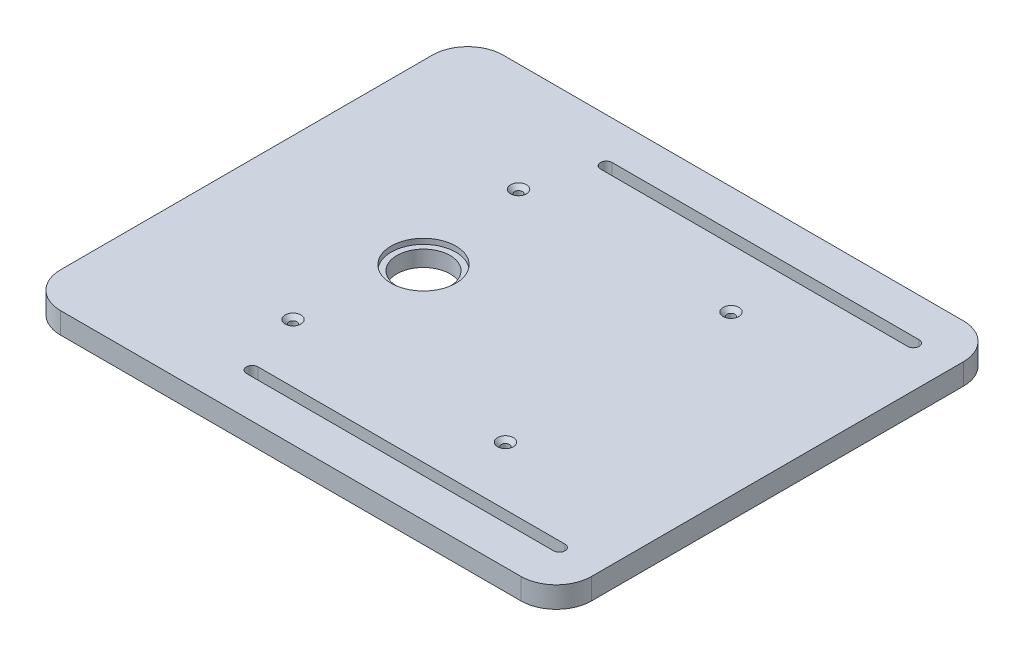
ISO-10303-21;
HEADER;
FILE_DESCRIPTION(('STEP AP214'),'2;1');
FILE_NAME('part.step','',(''),(''),'','','');
FILE_SCHEMA(('AUTOMOTIVE_DESIGN { 1 0 10303 214 1 1 1 1 }'));
ENDSEC;
DATA;
#1=APPLICATION_CONTEXT('core data for automotive mechanical design processes');
#2=APPLICATION_PROTOCOL_DEFINITION('international standard','automotive_design',2000,#1);
#3=PRODUCT_CONTEXT('',#1,'mechanical');
#4=PRODUCT('Part','Part','',(#3));
#5=PRODUCT_RELATED_PRODUCT_CATEGORY('part','',(#4));
#6=PRODUCT_DEFINITION_FORMATION('','',#4);
#7=PRODUCT_DEFINITION_CONTEXT('part definition',#1,'design');
#8=PRODUCT_DEFINITION('design','',#6,#7);
#9=PRODUCT_DEFINITION_SHAPE('','',#8);
#10=(LENGTH_UNIT() NAMED_UNIT(*) SI_UNIT(.MILLI.,.METRE.));
#11=(NAMED_UNIT(*) PLANE_ANGLE_UNIT() SI_UNIT($,.RADIAN.));
#12=(NAMED_UNIT(*) SI_UNIT($,.STERADIAN.) SOLID_ANGLE_UNIT());
#13=UNCERTAINTY_MEASURE_WITH_UNIT(LENGTH_MEASURE(1.E-05),#10,'distance_accuracy_value','');
#14=(GEOMETRIC_REPRESENTATION_CONTEXT(3) GLOBAL_UNCERTAINTY_ASSIGNED_CONTEXT((#13)) GLOBAL_UNIT_ASSIGNED_CONTEXT((#10,
#11,#12)) REPRESENTATION_CONTEXT('',''));
#15=CARTESIAN_POINT('',(0.,0.,0.));
#16=DIRECTION('',(0.,0.,1.));
#17=DIRECTION('',(1.,0.,0.));
#18=AXIS2_PLACEMENT_3D('',#15,#16,#17);
#19=CARTESIAN_POINT('',(20.,12.,-20.));
#20=DIRECTION('',(0.,-1.,0.));
#21=DIRECTION('',(0.,0.,-1.));
#22=AXIS2_PLACEMENT_3D('',#19,#20,#21);
#23=PLANE('',#22);
#24=CARTESIAN_POINT('',(90.,12.,-188.7));
#25=DIRECTION('',(0.,1.,0.));
#26=DIRECTION('',(0.,0.,1.));
#27=AXIS2_PLACEMENT_3D('',#24,#25,#26);
#28=CIRCLE('',#27,4.48);
#29=CARTESIAN_POINT('',(90.,12.,-184.22));
#30=VERTEX_POINT('',#29);
#31=EDGE_CURVE('E825',#30,#30,#28,.T.);
#32=ORIENTED_EDGE('',*,*,#31,.F.);
#33=EDGE_LOOP('',(#32));
#34=FACE_BOUND('',#33,.T.);
#35=CARTESIAN_POINT('',(210.,12.,-188.7));
#36=DIRECTION('',(0.,1.,0.));
#37=DIRECTION('',(0.,0.,1.));
#38=AXIS2_PLACEMENT_3D('',#35,#36,#37);
#39=CIRCLE('',#38,4.48000000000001);
#40=CARTESIAN_POINT('',(210.,12.,-184.22));
#41=VERTEX_POINT('',#40);
#42=EDGE_CURVE('E694',#41,#41,#39,.T.);
#43=ORIENTED_EDGE('',*,*,#42,.F.);
#44=EDGE_LOOP('',(#43));
#45=FACE_BOUND('',#44,.T.);
#46=CARTESIAN_POINT('',(90.,12.,-61.3));
#47=DIRECTION('',(0.,1.,0.));
#48=DIRECTION('',(0.,0.,1.));
#49=AXIS2_PLACEMENT_3D('',#46,#47,#48);
#50=CIRCLE('',#49,4.48);
#51=CARTESIAN_POINT('',(90.,12.,-56.82));
#52=VERTEX_POINT('',#51);
#53=EDGE_CURVE('E683',#52,#52,#50,.T.);
#54=ORIENTED_EDGE('',*,*,#53,.F.);
#55=EDGE_LOOP('',(#54));
#56=FACE_BOUND('',#55,.T.);
#57=DIRECTION('',(1.,0.,0.));
#58=VECTOR('',#57,1.);
#59=CARTESIAN_POINT('',(103.25,12.,-21.7499999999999));
#60=LINE('',#59,#58);
#61=CARTESIAN_POINT('',(103.25,12.,-21.75));
#62=VERTEX_POINT('',#61);
#63=CARTESIAN_POINT('',(276.75,12.,-21.75));
#64=VERTEX_POINT('',#63);
#65=EDGE_CURVE('E526',#62,#64,#60,.T.);
#66=ORIENTED_EDGE('',*,*,#65,.F.);
#67=CARTESIAN_POINT('',(103.25,12.,-25.));
#68=DIRECTION('',(0.,1.,0.));
#69=DIRECTION('',(0.,0.,1.));
#70=AXIS2_PLACEMENT_3D('',#67,#68,#69);
#71=CIRCLE('',#70,3.25);
#72=CARTESIAN_POINT('',(103.25,12.,-28.25));
#73=VERTEX_POINT('',#72);
#74=EDGE_CURVE('E550',#73,#62,#71,.T.);
#75=ORIENTED_EDGE('',*,*,#74,.F.);
#76=DIRECTION('',(1.,0.,0.));
#77=VECTOR('',#76,1.);
#78=CARTESIAN_POINT('',(103.25,12.,-28.25));
#79=LINE('',#78,#77);
#80=CARTESIAN_POINT('',(276.75,12.,-28.25));
#81=VERTEX_POINT('',#80);
#82=EDGE_CURVE('E547',#73,#81,#79,.T.);
#83=ORIENTED_EDGE('',*,*,#82,.T.);
#84=CARTESIAN_POINT('',(276.75,12.,-25.));
#85=DIRECTION('',(0.,1.,0.));
#86=DIRECTION('',(0.,0.,1.));
#87=AXIS2_PLACEMENT_3D('',#84,#85,#86);
#88=CIRCLE('',#87,3.25);
#89=EDGE_CURVE('E560',#64,#81,#88,.T.);
#90=ORIENTED_EDGE('',*,*,#89,.F.);
#91=EDGE_LOOP('',(#66,#75,#83,#90));
#92=FACE_BOUND('',#91,.T.);
#93=CARTESIAN_POINT('',(276.75,12.,-225.));
#94=DIRECTION('',(0.,1.,0.));
#95=DIRECTION('',(0.,0.,1.));
#96=AXIS2_PLACEMENT_3D('',#93,#94,#95);
#97=CIRCLE('',#96,3.25);
#98=CARTESIAN_POINT('',(276.75,12.,-221.75));
#99=VERTEX_POINT('',#98);
#100=CARTESIAN_POINT('',(276.75,12.,-228.25));
#101=VERTEX_POINT('',#100);
#102=EDGE_CURVE('E591',#99,#101,#97,.T.);
#103=ORIENTED_EDGE('',*,*,#102,.F.);
#104=DIRECTION('',(1.,0.,0.));
#105=VECTOR('',#104,1.);
#106=CARTESIAN_POINT('',(103.25,12.,-221.75));
#107=LINE('',#106,#105);
#108=CARTESIAN_POINT('',(103.25,12.,-221.75));
#109=VERTEX_POINT('',#108);
#110=EDGE_CURVE('E570',#109,#99,#107,.T.);
#111=ORIENTED_EDGE('',*,*,#110,.F.);
#112=CARTESIAN_POINT('',(103.25,12.,-225.));
#113=DIRECTION('',(0.,1.,0.));
#114=DIRECTION('',(0.,0.,1.));
#115=AXIS2_PLACEMENT_3D('',#112,#113,#114);
#116=CIRCLE('',#115,3.25);
#117=CARTESIAN_POINT('',(103.25,12.,-228.25));
#118=VERTEX_POINT('',#117);
#119=EDGE_CURVE('E580',#118,#109,#116,.T.);
#120=ORIENTED_EDGE('',*,*,#119,.F.);
#121=DIRECTION('',(1.,0.,0.));
#122=VECTOR('',#121,1.);
#123=CARTESIAN_POINT('',(103.25,12.,-228.25));
#124=LINE('',#123,#122);
#125=EDGE_CURVE('E577',#118,#101,#124,.T.);
#126=ORIENTED_EDGE('',*,*,#125,.T.);
#127=EDGE_LOOP('',(#103,#111,#120,#126));
#128=FACE_BOUND('',#127,.T.);
#129=CARTESIAN_POINT('',(100.,12.,-125.));
#130=DIRECTION('',(0.,1.,0.));
#131=DIRECTION('',(0.,0.,1.));
#132=AXIS2_PLACEMENT_3D('',#129,#130,#131);
#133=CIRCLE('',#132,18.25);
#134=CARTESIAN_POINT('',(100.,12.,-106.75));
#135=VERTEX_POINT('',#134);
#136=EDGE_CURVE('E602',#135,#135,#133,.T.);
#137=ORIENTED_EDGE('',*,*,#136,.F.);
#138=EDGE_LOOP('',(#137));
#139=FACE_BOUND('',#138,.T.);
#140=CARTESIAN_POINT('',(20.,12.,-20.));
#141=DIRECTION('',(0.,1.,0.));
#142=DIRECTION('',(0.,0.,-1.));
#143=AXIS2_PLACEMENT_3D('',#140,#141,#142);
#144=CIRCLE('',#143,20.);
#145=CARTESIAN_POINT('',(0.,12.,-20.));
#146=VERTEX_POINT('',#145);
#147=CARTESIAN_POINT('',(20.,12.,0.));
#148=VERTEX_POINT('',#147);
#149=EDGE_CURVE('E619',#146,#148,#144,.T.);
#150=ORIENTED_EDGE('',*,*,#149,.T.);
#151=DIRECTION('',(1.,0.,0.));
#152=VECTOR('',#151,1.);
#153=CARTESIAN_POINT('',(20.,12.,0.));
#154=LINE('',#153,#152);
#155=CARTESIAN_POINT('',(280.,12.,0.));
#156=VERTEX_POINT('',#155);
#157=EDGE_CURVE('E623',#148,#156,#154,.T.);
#158=ORIENTED_EDGE('',*,*,#157,.T.);
#159=CARTESIAN_POINT('',(280.,12.,-20.));
#160=DIRECTION('',(0.,1.,0.));
#161=DIRECTION('',(0.,0.,1.));
#162=AXIS2_PLACEMENT_3D('',#159,#160,#161);
#163=CIRCLE('',#162,20.);
#164=CARTESIAN_POINT('',(300.,12.,-20.));
#165=VERTEX_POINT('',#164);
#166=EDGE_CURVE('E627',#156,#165,#163,.T.);
#167=ORIENTED_EDGE('',*,*,#166,.T.);
#168=DIRECTION('',(0.,0.,-1.));
#169=VECTOR('',#168,1.);
#170=CARTESIAN_POINT('',(300.,12.,-20.));
#171=LINE('',#170,#169);
#172=CARTESIAN_POINT('',(300.,12.,-230.));
#173=VERTEX_POINT('',#172);
#174=EDGE_CURVE('E629',#165,#173,#171,.T.);
#175=ORIENTED_EDGE('',*,*,#174,.T.);
#176=CARTESIAN_POINT('',(280.,12.,-230.));
#177=DIRECTION('',(0.,1.,0.));
#178=DIRECTION('',(0.,0.,-1.));
#179=AXIS2_PLACEMENT_3D('',#176,#177,#178);
#180=CIRCLE('',#179,20.);
#181=CARTESIAN_POINT('',(280.,12.,-250.));
#182=VERTEX_POINT('',#181);
#183=EDGE_CURVE('E632',#173,#182,#180,.T.);
#184=ORIENTED_EDGE('',*,*,#183,.T.);
#185=DIRECTION('',(-1.,0.,0.));
#186=VECTOR('',#185,1.);
#187=CARTESIAN_POINT('',(20.,12.,-250.));
#188=LINE('',#187,#186);
#189=CARTESIAN_POINT('',(20.,12.,-250.));
#190=VERTEX_POINT('',#189);
#191=EDGE_CURVE('E634',#182,#190,#188,.T.);
#192=ORIENTED_EDGE('',*,*,#191,.T.);
#193=CARTESIAN_POINT('',(20.,12.,-230.));
#194=DIRECTION('',(0.,1.,0.));
#195=DIRECTION('',(0.,0.,-1.));
#196=AXIS2_PLACEMENT_3D('',#193,#194,#195);
#197=CIRCLE('',#196,20.);
#198=CARTESIAN_POINT('',(0.,12.,-230.));
#199=VERTEX_POINT('',#198);
#200=EDGE_CURVE('E636',#190,#199,#197,.T.);
#201=ORIENTED_EDGE('',*,*,#200,.T.);
#202=DIRECTION('',(0.,0.,1.));
#203=VECTOR('',#202,1.);
#204=CARTESIAN_POINT('',(0.,12.,-20.));
#205=LINE('',#204,#203);
#206=EDGE_CURVE('E638',#199,#146,#205,.T.);
#207=ORIENTED_EDGE('',*,*,#206,.T.);
#208=EDGE_LOOP('',(#150,#158,#167,#175,#184,#192,#201,#207));
#209=FACE_BOUND('',#208,.T.);
#210=CARTESIAN_POINT('',(210.,12.,-61.3));
#211=DIRECTION('',(0.,1.,0.));
#212=DIRECTION('',(0.,0.,1.));
#213=AXIS2_PLACEMENT_3D('',#210,#211,#212);
#214=CIRCLE('',#213,4.48000000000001);
#215=CARTESIAN_POINT('',(210.,12.,-56.82));
#216=VERTEX_POINT('',#215);
#217=EDGE_CURVE('E687',#216,#216,#214,.T.);
#218=ORIENTED_EDGE('',*,*,#217,.F.);
#219=EDGE_LOOP('',(#218));
#220=FACE_BOUND('',#219,.T.);
#221=ADVANCED_FACE('F191',(#34,#45,#56,#92,#128,#139,#209,#220),#23,.F.);
#222=CARTESIAN_POINT('',(20.,0.,-20.));
#223=DIRECTION('',(0.,-1.,0.));
#224=DIRECTION('',(0.,0.,-1.));
#225=AXIS2_PLACEMENT_3D('',#222,#223,#224);
#226=PLANE('',#225);
#227=CARTESIAN_POINT('',(103.25,0.,-225.));
#228=DIRECTION('',(0.,1.,0.));
#229=DIRECTION('',(0.,0.,1.));
#230=AXIS2_PLACEMENT_3D('',#227,#228,#229);
#231=CIRCLE('',#230,3.25);
#232=CARTESIAN_POINT('',(103.25,0.,-228.25));
#233=VERTEX_POINT('',#232);
#234=CARTESIAN_POINT('',(103.25,0.,-221.75));
#235=VERTEX_POINT('',#234);
#236=EDGE_CURVE('E583',#233,#235,#231,.T.);
#237=ORIENTED_EDGE('',*,*,#236,.T.);
#238=DIRECTION('',(1.,0.,0.));
#239=VECTOR('',#238,1.);
#240=CARTESIAN_POINT('',(103.25,0.,-221.75));
#241=LINE('',#240,#239);
#242=CARTESIAN_POINT('',(276.75,0.,-221.75));
#243=VERTEX_POINT('',#242);
#244=EDGE_CURVE('E572',#235,#243,#241,.T.);
#245=ORIENTED_EDGE('',*,*,#244,.T.);
#246=CARTESIAN_POINT('',(276.75,0.,-225.));
#247=DIRECTION('',(0.,1.,0.));
#248=DIRECTION('',(0.,0.,1.));
#249=AXIS2_PLACEMENT_3D('',#246,#247,#248);
#250=CIRCLE('',#249,3.25);
#251=CARTESIAN_POINT('',(276.75,0.,-228.25));
#252=VERTEX_POINT('',#251);
#253=EDGE_CURVE('E594',#243,#252,#250,.T.);
#254=ORIENTED_EDGE('',*,*,#253,.T.);
#255=DIRECTION('',(1.,0.,0.));
#256=VECTOR('',#255,1.);
#257=CARTESIAN_POINT('',(103.25,0.,-228.25));
#258=LINE('',#257,#256);
#259=EDGE_CURVE('E575',#233,#252,#258,.T.);
#260=ORIENTED_EDGE('',*,*,#259,.F.);
#261=EDGE_LOOP('',(#237,#245,#254,#260));
#262=FACE_BOUND('',#261,.T.);
#263=CARTESIAN_POINT('',(100.,0.,-125.));
#264=DIRECTION('',(0.,1.,0.));
#265=DIRECTION('',(0.,0.,1.));
#266=AXIS2_PLACEMENT_3D('',#263,#264,#265);
#267=CIRCLE('',#266,15.);
#268=CARTESIAN_POINT('',(100.,0.,-110.));
#269=VERTEX_POINT('',#268);
#270=EDGE_CURVE('E614',#269,#269,#267,.T.);
#271=ORIENTED_EDGE('',*,*,#270,.T.);
#272=EDGE_LOOP('',(#271));
#273=FACE_BOUND('',#272,.T.);
#274=CARTESIAN_POINT('',(20.,0.,-20.));
#275=DIRECTION('',(0.,1.,0.));
#276=DIRECTION('',(0.,0.,-1.));
#277=AXIS2_PLACEMENT_3D('',#274,#275,#276);
#278=CIRCLE('',#277,20.);
#279=CARTESIAN_POINT('',(0.,0.,-20.));
#280=VERTEX_POINT('',#279);
#281=CARTESIAN_POINT('',(20.,0.,0.));
#282=VERTEX_POINT('',#281);
#283=EDGE_CURVE('E618',#280,#282,#278,.T.);
#284=ORIENTED_EDGE('',*,*,#283,.F.);
#285=DIRECTION('',(0.,0.,1.));
#286=VECTOR('',#285,1.);
#287=CARTESIAN_POINT('',(0.,0.,-20.));
#288=LINE('',#287,#286);
#289=CARTESIAN_POINT('',(0.,0.,-230.));
#290=VERTEX_POINT('',#289);
#291=EDGE_CURVE('E624',#290,#280,#288,.T.);
#292=ORIENTED_EDGE('',*,*,#291,.F.);
#293=CARTESIAN_POINT('',(20.,0.,-230.));
#294=DIRECTION('',(0.,1.,0.));
#295=DIRECTION('',(0.,0.,-1.));
#296=AXIS2_PLACEMENT_3D('',#293,#294,#295);
#297=CIRCLE('',#296,20.);
#298=CARTESIAN_POINT('',(20.,0.,-250.));
#299=VERTEX_POINT('',#298);
#300=EDGE_CURVE('E655',#299,#290,#297,.T.);
#301=ORIENTED_EDGE('',*,*,#300,.F.);
#302=DIRECTION('',(-1.,0.,0.));
#303=VECTOR('',#302,1.);
#304=CARTESIAN_POINT('',(20.,0.,-250.));
#305=LINE('',#304,#303);
#306=CARTESIAN_POINT('',(280.,0.,-250.));
#307=VERTEX_POINT('',#306);
#308=EDGE_CURVE('E653',#307,#299,#305,.T.);
#309=ORIENTED_EDGE('',*,*,#308,.F.);
#310=CARTESIAN_POINT('',(280.,0.,-230.));
#311=DIRECTION('',(0.,1.,0.));
#312=DIRECTION('',(0.,0.,-1.));
#313=AXIS2_PLACEMENT_3D('',#310,#311,#312);
#314=CIRCLE('',#313,20.);
#315=CARTESIAN_POINT('',(300.,0.,-230.));
#316=VERTEX_POINT('',#315);
#317=EDGE_CURVE('E651',#316,#307,#314,.T.);
#318=ORIENTED_EDGE('',*,*,#317,.F.);
#319=DIRECTION('',(0.,0.,-1.));
#320=VECTOR('',#319,1.);
#321=CARTESIAN_POINT('',(300.,0.,-20.));
#322=LINE('',#321,#320);
#323=CARTESIAN_POINT('',(300.,0.,-20.));
#324=VERTEX_POINT('',#323);
#325=EDGE_CURVE('E649',#324,#316,#322,.T.);
#326=ORIENTED_EDGE('',*,*,#325,.F.);
#327=CARTESIAN_POINT('',(280.,0.,-20.));
#328=DIRECTION('',(0.,1.,0.));
#329=DIRECTION('',(0.,0.,1.));
#330=AXIS2_PLACEMENT_3D('',#327,#328,#329);
#331=CIRCLE('',#330,20.);
#332=CARTESIAN_POINT('',(280.,0.,0.));
#333=VERTEX_POINT('',#332);
#334=EDGE_CURVE('E647',#333,#324,#331,.T.);
#335=ORIENTED_EDGE('',*,*,#334,.F.);
#336=DIRECTION('',(1.,0.,0.));
#337=VECTOR('',#336,1.);
#338=CARTESIAN_POINT('',(20.,0.,0.));
#339=LINE('',#338,#337);
#340=EDGE_CURVE('E644',#282,#333,#339,.T.);
#341=ORIENTED_EDGE('',*,*,#340,.F.);
#342=EDGE_LOOP('',(#284,#292,#301,#309,#318,#326,#335,#341));
#343=FACE_BOUND('',#342,.T.);
#344=DIRECTION('',(1.,0.,0.));
#345=VECTOR('',#344,1.);
#346=CARTESIAN_POINT('',(103.25,0.,-28.25));
#347=LINE('',#346,#345);
#348=CARTESIAN_POINT('',(103.25,0.,-28.25));
#349=VERTEX_POINT('',#348);
#350=CARTESIAN_POINT('',(276.75,0.,-28.25));
#351=VERTEX_POINT('',#350);
#352=EDGE_CURVE('E545',#349,#351,#347,.T.);
#353=ORIENTED_EDGE('',*,*,#352,.F.);
#354=CARTESIAN_POINT('',(103.25,0.,-25.));
#355=DIRECTION('',(0.,1.,0.));
#356=DIRECTION('',(0.,0.,1.));
#357=AXIS2_PLACEMENT_3D('',#354,#355,#356);
#358=CIRCLE('',#357,3.25);
#359=CARTESIAN_POINT('',(103.25,0.,-21.75));
#360=VERTEX_POINT('',#359);
#361=EDGE_CURVE('E553',#349,#360,#358,.T.);
#362=ORIENTED_EDGE('',*,*,#361,.T.);
#363=DIRECTION('',(1.,0.,0.));
#364=VECTOR('',#363,1.);
#365=CARTESIAN_POINT('',(103.25,0.,-21.75));
#366=LINE('',#365,#364);
#367=CARTESIAN_POINT('',(276.75,0.,-21.75));
#368=VERTEX_POINT('',#367);
#369=EDGE_CURVE('E542',#360,#368,#366,.T.);
#370=ORIENTED_EDGE('',*,*,#369,.T.);
#371=CARTESIAN_POINT('',(276.75,0.,-25.));
#372=DIRECTION('',(0.,1.,0.));
#373=DIRECTION('',(0.,0.,1.));
#374=AXIS2_PLACEMENT_3D('',#371,#372,#373);
#375=CIRCLE('',#374,3.25);
#376=EDGE_CURVE('E563',#368,#351,#375,.T.);
#377=ORIENTED_EDGE('',*,*,#376,.T.);
#378=EDGE_LOOP('',(#353,#362,#370,#377));
#379=FACE_BOUND('',#378,.T.);
#380=CARTESIAN_POINT('',(77.9999999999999,0.,-55.2));
#381=DIRECTION('',(0.,-1.,0.));
#382=DIRECTION('',(0.,0.,-1.));
#383=AXIS2_PLACEMENT_3D('',#380,#381,#382);
#384=CIRCLE('',#383,2.99999999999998);
#385=CARTESIAN_POINT('',(80.9999999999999,0.,-55.2));
#386=VERTEX_POINT('',#385);
#387=CARTESIAN_POINT('',(75.,0.,-55.2));
#388=VERTEX_POINT('',#387);
#389=EDGE_CURVE('E217',#386,#388,#384,.T.);
#390=ORIENTED_EDGE('',*,*,#389,.F.);
#391=DIRECTION('',(-1.,0.,0.));
#392=VECTOR('',#391,1.);
#393=CARTESIAN_POINT('',(80.9999999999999,0.,-55.2));
#394=LINE('',#393,#392);
#395=CARTESIAN_POINT('',(219.,0.,-55.2));
#396=VERTEX_POINT('',#395);
#397=EDGE_CURVE('E481',#396,#386,#394,.T.);
#398=ORIENTED_EDGE('',*,*,#397,.F.);
#399=CARTESIAN_POINT('',(222.,0.,-55.2));
#400=DIRECTION('',(0.,-1.,0.));
#401=DIRECTION('',(0.,0.,-1.));
#402=AXIS2_PLACEMENT_3D('',#399,#400,#401);
#403=CIRCLE('',#402,3.00000000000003);
#404=CARTESIAN_POINT('',(225.,0.,-55.2));
#405=VERTEX_POINT('',#404);
#406=EDGE_CURVE('E519',#405,#396,#403,.T.);
#407=ORIENTED_EDGE('',*,*,#406,.F.);
#408=DIRECTION('',(0.,0.,1.));
#409=VECTOR('',#408,1.);
#410=CARTESIAN_POINT('',(225.,0.,-55.2));
#411=LINE('',#410,#409);
#412=CARTESIAN_POINT('',(225.,0.,-67.4));
#413=VERTEX_POINT('',#412);
#414=EDGE_CURVE('E516',#413,#405,#411,.T.);
#415=ORIENTED_EDGE('',*,*,#414,.F.);
#416=CARTESIAN_POINT('',(222.,0.,-67.4));
#417=DIRECTION('',(0.,-1.,0.));
#418=DIRECTION('',(0.,0.,-1.));
#419=AXIS2_PLACEMENT_3D('',#416,#417,#418);
#420=CIRCLE('',#419,3.00000000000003);
#421=CARTESIAN_POINT('',(219.,0.,-67.4));
#422=VERTEX_POINT('',#421);
#423=EDGE_CURVE('E513',#422,#413,#420,.T.);
#424=ORIENTED_EDGE('',*,*,#423,.F.);
#425=DIRECTION('',(1.,0.,0.));
#426=VECTOR('',#425,1.);
#427=CARTESIAN_POINT('',(80.9999999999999,0.,-67.4));
#428=LINE('',#427,#426);
#429=CARTESIAN_POINT('',(80.9999999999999,0.,-67.4));
#430=VERTEX_POINT('',#429);
#431=EDGE_CURVE('E510',#430,#422,#428,.T.);
#432=ORIENTED_EDGE('',*,*,#431,.F.);
#433=CARTESIAN_POINT('',(77.9999999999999,0.,-67.4));
#434=DIRECTION('',(0.,-1.,0.));
#435=DIRECTION('',(0.,0.,-1.));
#436=AXIS2_PLACEMENT_3D('',#433,#434,#435);
#437=CIRCLE('',#436,2.99999999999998);
#438=CARTESIAN_POINT('',(75.,0.,-67.4));
#439=VERTEX_POINT('',#438);
#440=EDGE_CURVE('E507',#439,#430,#437,.T.);
#441=ORIENTED_EDGE('',*,*,#440,.F.);
#442=DIRECTION('',(0.,0.,-1.));
#443=VECTOR('',#442,1.);
#444=CARTESIAN_POINT('',(75.,0.,-55.2));
#445=LINE('',#444,#443);
#446=EDGE_CURVE('E504',#388,#439,#445,.T.);
#447=ORIENTED_EDGE('',*,*,#446,.F.);
#448=EDGE_LOOP('',(#390,#398,#407,#415,#424,#432,#441,#447));
#449=FACE_BOUND('',#448,.T.);
#450=DIRECTION('',(-1.,0.,0.));
#451=VECTOR('',#450,1.);
#452=CARTESIAN_POINT('',(80.9999999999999,0.,-194.8));
#453=LINE('',#452,#451);
#454=CARTESIAN_POINT('',(219.,0.,-194.8));
#455=VERTEX_POINT('',#454);
#456=CARTESIAN_POINT('',(80.9999999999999,0.,-194.8));
#457=VERTEX_POINT('',#456);
#458=EDGE_CURVE('E447',#455,#457,#453,.T.);
#459=ORIENTED_EDGE('',*,*,#458,.T.);
#460=CARTESIAN_POINT('',(77.9999999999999,0.,-194.8));
#461=DIRECTION('',(0.,1.,0.));
#462=DIRECTION('',(0.,0.,1.));
#463=AXIS2_PLACEMENT_3D('',#460,#461,#462);
#464=CIRCLE('',#463,2.99999999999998);
#465=CARTESIAN_POINT('',(75.,0.,-194.8));
#466=VERTEX_POINT('',#465);
#467=EDGE_CURVE('E209',#457,#466,#464,.T.);
#468=ORIENTED_EDGE('',*,*,#467,.T.);
#469=DIRECTION('',(0.,0.,1.));
#470=VECTOR('',#469,1.);
#471=CARTESIAN_POINT('',(75.,0.,-194.8));
#472=LINE('',#471,#470);
#473=CARTESIAN_POINT('',(75.,0.,-182.6));
#474=VERTEX_POINT('',#473);
#475=EDGE_CURVE('E427',#466,#474,#472,.T.);
#476=ORIENTED_EDGE('',*,*,#475,.T.);
#477=CARTESIAN_POINT('',(77.9999999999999,0.,-182.6));
#478=DIRECTION('',(0.,1.,0.));
#479=DIRECTION('',(0.,0.,1.));
#480=AXIS2_PLACEMENT_3D('',#477,#478,#479);
#481=CIRCLE('',#480,2.99999999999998);
#482=CARTESIAN_POINT('',(80.9999999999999,0.,-182.6));
#483=VERTEX_POINT('',#482);
#484=EDGE_CURVE('E430',#474,#483,#481,.T.);
#485=ORIENTED_EDGE('',*,*,#484,.T.);
#486=DIRECTION('',(1.,0.,0.));
#487=VECTOR('',#486,1.);
#488=CARTESIAN_POINT('',(80.9999999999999,0.,-182.6));
#489=LINE('',#488,#487);
#490=CARTESIAN_POINT('',(219.,0.,-182.6));
#491=VERTEX_POINT('',#490);
#492=EDGE_CURVE('E459',#483,#491,#489,.T.);
#493=ORIENTED_EDGE('',*,*,#492,.T.);
#494=CARTESIAN_POINT('',(222.,0.,-182.6));
#495=DIRECTION('',(0.,1.,0.));
#496=DIRECTION('',(0.,0.,1.));
#497=AXIS2_PLACEMENT_3D('',#494,#495,#496);
#498=CIRCLE('',#497,3.00000000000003);
#499=CARTESIAN_POINT('',(225.,0.,-182.6));
#500=VERTEX_POINT('',#499);
#501=EDGE_CURVE('E456',#491,#500,#498,.T.);
#502=ORIENTED_EDGE('',*,*,#501,.T.);
#503=DIRECTION('',(0.,0.,-1.));
#504=VECTOR('',#503,1.);
#505=CARTESIAN_POINT('',(225.,0.,-194.8));
#506=LINE('',#505,#504);
#507=CARTESIAN_POINT('',(225.,0.,-194.8));
#508=VERTEX_POINT('',#507);
#509=EDGE_CURVE('E453',#500,#508,#506,.T.);
#510=ORIENTED_EDGE('',*,*,#509,.T.);
#511=CARTESIAN_POINT('',(222.,0.,-194.8));
#512=DIRECTION('',(0.,1.,0.));
#513=DIRECTION('',(0.,0.,1.));
#514=AXIS2_PLACEMENT_3D('',#511,#512,#513);
#515=CIRCLE('',#514,3.00000000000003);
#516=EDGE_CURVE('E450',#508,#455,#515,.T.);
#517=ORIENTED_EDGE('',*,*,#516,.T.);
#518=EDGE_LOOP('',(#459,#468,#476,#485,#493,#502,#510,#517));
#519=FACE_BOUND('',#518,.T.);
#520=ADVANCED_FACE('F725',(#262,#273,#343,#379,#449,#519),#226,.T.);
#521=CARTESIAN_POINT('',(20.,12.,-20.));
#522=DIRECTION('',(0.,-1.,0.));
#523=DIRECTION('',(0.,0.,-1.));
#524=AXIS2_PLACEMENT_3D('',#521,#522,#523);
#525=CYLINDRICAL_SURFACE('',#524,20.);
#526=ORIENTED_EDGE('',*,*,#283,.T.);
#527=DIRECTION('',(0.,-1.,0.));
#528=VECTOR('',#527,1.);
#529=CARTESIAN_POINT('',(20.,12.,0.));
#530=LINE('',#529,#528);
#531=EDGE_CURVE('E13',#148,#282,#530,.T.);
#532=ORIENTED_EDGE('',*,*,#531,.F.);
#533=ORIENTED_EDGE('',*,*,#149,.F.);
#534=DIRECTION('',(0.,-1.,0.));
#535=VECTOR('',#534,1.);
#536=CARTESIAN_POINT('',(0.,12.,-20.));
#537=LINE('',#536,#535);
#538=EDGE_CURVE('E640',#146,#280,#537,.T.);
#539=ORIENTED_EDGE('',*,*,#538,.T.);
#540=EDGE_LOOP('',(#526,#532,#533,#539));
#541=FACE_BOUND('',#540,.T.);
#542=ADVANCED_FACE('F193',(#541),#525,.T.);
#543=CARTESIAN_POINT('',(20.,12.,0.));
#544=DIRECTION('',(0.,0.,-1.));
#545=DIRECTION('',(-1.,0.,0.));
#546=AXIS2_PLACEMENT_3D('',#543,#544,#545);
#547=PLANE('',#546);
#548=ORIENTED_EDGE('',*,*,#340,.T.);
#549=DIRECTION('',(0.,-1.,0.));
#550=VECTOR('',#549,1.);
#551=CARTESIAN_POINT('',(280.,12.,0.));
#552=LINE('',#551,#550);
#553=EDGE_CURVE('E201',#156,#333,#552,.T.);
#554=ORIENTED_EDGE('',*,*,#553,.F.);
#555=ORIENTED_EDGE('',*,*,#157,.F.);
#556=ORIENTED_EDGE('',*,*,#531,.T.);
#557=EDGE_LOOP('',(#548,#554,#555,#556));
#558=FACE_BOUND('',#557,.T.);
#559=ADVANCED_FACE('F761',(#558),#547,.F.);
#560=CARTESIAN_POINT('',(280.,12.,-20.));
#561=DIRECTION('',(0.,-1.,0.));
#562=DIRECTION('',(0.,0.,-1.));
#563=AXIS2_PLACEMENT_3D('',#560,#561,#562);
#564=CYLINDRICAL_SURFACE('',#563,20.);
#565=ORIENTED_EDGE('',*,*,#334,.T.);
#566=DIRECTION('',(0.,-1.,0.));
#567=VECTOR('',#566,1.);
#568=CARTESIAN_POINT('',(300.,12.,-20.));
#569=LINE('',#568,#567);
#570=EDGE_CURVE('E674',#165,#324,#569,.T.);
#571=ORIENTED_EDGE('',*,*,#570,.F.);
#572=ORIENTED_EDGE('',*,*,#166,.F.);
#573=ORIENTED_EDGE('',*,*,#553,.T.);
#574=EDGE_LOOP('',(#565,#571,#572,#573));
#575=FACE_BOUND('',#574,.T.);
#576=ADVANCED_FACE('F758',(#575),#564,.T.);
#577=CARTESIAN_POINT('',(300.,12.,-20.));
#578=DIRECTION('',(-1.,0.,0.));
#579=DIRECTION('',(0.,0.,1.));
#580=AXIS2_PLACEMENT_3D('',#577,#578,#579);
#581=PLANE('',#580);
#582=ORIENTED_EDGE('',*,*,#325,.T.);
#583=DIRECTION('',(0.,-1.,0.));
#584=VECTOR('',#583,1.);
#585=CARTESIAN_POINT('',(300.,12.,-230.));
#586=LINE('',#585,#584);
#587=EDGE_CURVE('E671',#173,#316,#586,.T.);
#588=ORIENTED_EDGE('',*,*,#587,.F.);
#589=ORIENTED_EDGE('',*,*,#174,.F.);
#590=ORIENTED_EDGE('',*,*,#570,.T.);
#591=EDGE_LOOP('',(#582,#588,#589,#590));
#592=FACE_BOUND('',#591,.T.);
#593=ADVANCED_FACE('F754',(#592),#581,.F.);
#594=CARTESIAN_POINT('',(280.,12.,-230.));
#595=DIRECTION('',(0.,-1.,0.));
#596=DIRECTION('',(0.,0.,-1.));
#597=AXIS2_PLACEMENT_3D('',#594,#595,#596);
#598=CYLINDRICAL_SURFACE('',#597,20.);
#599=ORIENTED_EDGE('',*,*,#317,.T.);
#600=DIRECTION('',(0.,-1.,0.));
#601=VECTOR('',#600,1.);
#602=CARTESIAN_POINT('',(280.,12.,-250.));
#603=LINE('',#602,#601);
#604=EDGE_CURVE('E668',#182,#307,#603,.T.);
#605=ORIENTED_EDGE('',*,*,#604,.F.);
#606=ORIENTED_EDGE('',*,*,#183,.F.);
#607=ORIENTED_EDGE('',*,*,#587,.T.);
#608=EDGE_LOOP('',(#599,#605,#606,#607));
#609=FACE_BOUND('',#608,.T.);
#610=ADVANCED_FACE('F750',(#609),#598,.T.);
#611=CARTESIAN_POINT('',(20.,12.,-250.));
#612=DIRECTION('',(0.,0.,1.));
#613=DIRECTION('',(1.,0.,0.));
#614=AXIS2_PLACEMENT_3D('',#611,#612,#613);
#615=PLANE('',#614);
#616=ORIENTED_EDGE('',*,*,#308,.T.);
#617=DIRECTION('',(0.,-1.,0.));
#618=VECTOR('',#617,1.);
#619=CARTESIAN_POINT('',(20.,12.,-250.));
#620=LINE('',#619,#618);
#621=EDGE_CURVE('E665',#190,#299,#620,.T.);
#622=ORIENTED_EDGE('',*,*,#621,.F.);
#623=ORIENTED_EDGE('',*,*,#191,.F.);
#624=ORIENTED_EDGE('',*,*,#604,.T.);
#625=EDGE_LOOP('',(#616,#622,#623,#624));
#626=FACE_BOUND('',#625,.T.);
#627=ADVANCED_FACE('F746',(#626),#615,.F.);
#628=CARTESIAN_POINT('',(20.,12.,-230.));
#629=DIRECTION('',(0.,-1.,0.));
#630=DIRECTION('',(0.,0.,-1.));
#631=AXIS2_PLACEMENT_3D('',#628,#629,#630);
#632=CYLINDRICAL_SURFACE('',#631,20.);
#633=ORIENTED_EDGE('',*,*,#300,.T.);
#634=DIRECTION('',(0.,-1.,0.));
#635=VECTOR('',#634,1.);
#636=CARTESIAN_POINT('',(0.,12.,-230.));
#637=LINE('',#636,#635);
#638=EDGE_CURVE('E662',#199,#290,#637,.T.);
#639=ORIENTED_EDGE('',*,*,#638,.F.);
#640=ORIENTED_EDGE('',*,*,#200,.F.);
#641=ORIENTED_EDGE('',*,*,#621,.T.);
#642=EDGE_LOOP('',(#633,#639,#640,#641));
#643=FACE_BOUND('',#642,.T.);
#644=ADVANCED_FACE('F742',(#643),#632,.T.);
#645=CARTESIAN_POINT('',(0.,12.,-20.));
#646=DIRECTION('',(1.,0.,0.));
#647=DIRECTION('',(0.,0.,-1.));
#648=AXIS2_PLACEMENT_3D('',#645,#646,#647);
#649=PLANE('',#648);
#650=ORIENTED_EDGE('',*,*,#291,.T.);
#651=ORIENTED_EDGE('',*,*,#538,.F.);
#652=ORIENTED_EDGE('',*,*,#206,.F.);
#653=ORIENTED_EDGE('',*,*,#638,.T.);
#654=EDGE_LOOP('',(#650,#651,#652,#653));
#655=FACE_BOUND('',#654,.T.);
#656=ADVANCED_FACE('F739',(#655),#649,.F.);
#657=CARTESIAN_POINT('',(100.,12.,-125.));
#658=DIRECTION('',(0.,1.,0.));
#659=DIRECTION('',(0.,0.,1.));
#660=AXIS2_PLACEMENT_3D('',#657,#658,#659);
#661=CYLINDRICAL_SURFACE('',#660,15.);
#662=ORIENTED_EDGE('',*,*,#270,.F.);
#663=EDGE_LOOP('',(#662));
#664=FACE_BOUND('',#663,.T.);
#665=CARTESIAN_POINT('',(100.,9.,-125.));
#666=DIRECTION('',(0.,1.,0.));
#667=DIRECTION('',(0.,0.,1.));
#668=AXIS2_PLACEMENT_3D('',#665,#666,#667);
#669=CIRCLE('',#668,15.);
#670=CARTESIAN_POINT('',(100.,9.,-110.));
#671=VERTEX_POINT('',#670);
#672=EDGE_CURVE('E610',#671,#671,#669,.T.);
#673=ORIENTED_EDGE('',*,*,#672,.T.);
#674=EDGE_LOOP('',(#673));
#675=FACE_BOUND('',#674,.T.);
#676=ADVANCED_FACE('F736',(#664,#675),#661,.F.);
#677=CARTESIAN_POINT('',(115.,9.,-125.));
#678=DIRECTION('',(0.,-1.,0.));
#679=DIRECTION('',(0.,0.,-1.));
#680=AXIS2_PLACEMENT_3D('',#677,#678,#679);
#681=PLANE('',#680);
#682=ORIENTED_EDGE('',*,*,#672,.F.);
#683=EDGE_LOOP('',(#682));
#684=FACE_BOUND('',#683,.T.);
#685=CARTESIAN_POINT('',(100.,9.,-125.));
#686=DIRECTION('',(0.,1.,0.));
#687=DIRECTION('',(0.,0.,1.));
#688=AXIS2_PLACEMENT_3D('',#685,#686,#687);
#689=CIRCLE('',#688,18.25);
#690=CARTESIAN_POINT('',(100.,9.,-106.75));
#691=VERTEX_POINT('',#690);
#692=EDGE_CURVE('E606',#691,#691,#689,.T.);
#693=ORIENTED_EDGE('',*,*,#692,.T.);
#694=EDGE_LOOP('',(#693));
#695=FACE_BOUND('',#694,.T.);
#696=ADVANCED_FACE('F935',(#684,#695),#681,.F.);
#697=CARTESIAN_POINT('',(100.,12.,-125.));
#698=DIRECTION('',(0.,1.,0.));
#699=DIRECTION('',(0.,0.,1.));
#700=AXIS2_PLACEMENT_3D('',#697,#698,#699);
#701=CYLINDRICAL_SURFACE('',#700,18.25);
#702=ORIENTED_EDGE('',*,*,#692,.F.);
#703=EDGE_LOOP('',(#702));
#704=FACE_BOUND('',#703,.T.);
#705=ORIENTED_EDGE('',*,*,#136,.T.);
#706=EDGE_LOOP('',(#705));
#707=FACE_BOUND('',#706,.T.);
#708=ADVANCED_FACE('F932',(#704,#707),#701,.F.);
#709=CARTESIAN_POINT('',(276.75,12.,-225.));
#710=DIRECTION('',(0.,1.,0.));
#711=DIRECTION('',(0.,0.,1.));
#712=AXIS2_PLACEMENT_3D('',#709,#710,#711);
#713=CYLINDRICAL_SURFACE('',#712,3.25);
#714=ORIENTED_EDGE('',*,*,#253,.F.);
#715=DIRECTION('',(0.,1.,0.));
#716=VECTOR('',#715,1.);
#717=CARTESIAN_POINT('',(276.75,12.,-221.75));
#718=LINE('',#717,#716);
#719=EDGE_CURVE('E599',#99,#243,#718,.F.);
#720=ORIENTED_EDGE('',*,*,#719,.F.);
#721=ORIENTED_EDGE('',*,*,#102,.T.);
#722=DIRECTION('',(0.,1.,0.));
#723=VECTOR('',#722,1.);
#724=CARTESIAN_POINT('',(276.75,12.,-228.25));
#725=LINE('',#724,#723);
#726=EDGE_CURVE('E597',#252,#101,#725,.T.);
#727=ORIENTED_EDGE('',*,*,#726,.F.);
#728=EDGE_LOOP('',(#714,#720,#721,#727));
#729=FACE_BOUND('',#728,.T.);
#730=ADVANCED_FACE('F928',(#729),#713,.F.);
#731=CARTESIAN_POINT('',(103.25,12.,-225.));
#732=DIRECTION('',(0.,1.,0.));
#733=DIRECTION('',(0.,0.,1.));
#734=AXIS2_PLACEMENT_3D('',#731,#732,#733);
#735=CYLINDRICAL_SURFACE('',#734,3.25);
#736=ORIENTED_EDGE('',*,*,#119,.T.);
#737=DIRECTION('',(0.,1.,0.));
#738=VECTOR('',#737,1.);
#739=CARTESIAN_POINT('',(103.25,12.,-221.75));
#740=LINE('',#739,#738);
#741=EDGE_CURVE('E586',#235,#109,#740,.T.);
#742=ORIENTED_EDGE('',*,*,#741,.F.);
#743=ORIENTED_EDGE('',*,*,#236,.F.);
#744=DIRECTION('',(0.,1.,0.));
#745=VECTOR('',#744,1.);
#746=CARTESIAN_POINT('',(103.25,12.,-228.25));
#747=LINE('',#746,#745);
#748=EDGE_CURVE('E588',#118,#233,#747,.F.);
#749=ORIENTED_EDGE('',*,*,#748,.F.);
#750=EDGE_LOOP('',(#736,#742,#743,#749));
#751=FACE_BOUND('',#750,.T.);
#752=ADVANCED_FACE('F924',(#751),#735,.F.);
#753=CARTESIAN_POINT('',(103.25,12.,-228.25));
#754=DIRECTION('',(0.,0.,-1.));
#755=DIRECTION('',(-1.,0.,0.));
#756=AXIS2_PLACEMENT_3D('',#753,#754,#755);
#757=PLANE('',#756);
#758=ORIENTED_EDGE('',*,*,#726,.T.);
#759=ORIENTED_EDGE('',*,*,#125,.F.);
#760=ORIENTED_EDGE('',*,*,#748,.T.);
#761=ORIENTED_EDGE('',*,*,#259,.T.);
#762=EDGE_LOOP('',(#758,#759,#760,#761));
#763=FACE_BOUND('',#762,.T.);
#764=ADVANCED_FACE('F920',(#763),#757,.F.);
#765=CARTESIAN_POINT('',(103.25,12.,-221.75));
#766=DIRECTION('',(0.,0.,1.));
#767=DIRECTION('',(1.,0.,0.));
#768=AXIS2_PLACEMENT_3D('',#765,#766,#767);
#769=PLANE('',#768);
#770=ORIENTED_EDGE('',*,*,#719,.T.);
#771=ORIENTED_EDGE('',*,*,#244,.F.);
#772=ORIENTED_EDGE('',*,*,#741,.T.);
#773=ORIENTED_EDGE('',*,*,#110,.T.);
#774=EDGE_LOOP('',(#770,#771,#772,#773));
#775=FACE_BOUND('',#774,.T.);
#776=ADVANCED_FACE('F916',(#775),#769,.F.);
#777=CARTESIAN_POINT('',(276.75,12.,-25.));
#778=DIRECTION('',(0.,1.,0.));
#779=DIRECTION('',(0.,0.,1.));
#780=AXIS2_PLACEMENT_3D('',#777,#778,#779);
#781=CYLINDRICAL_SURFACE('',#780,3.25);
#782=ORIENTED_EDGE('',*,*,#376,.F.);
#783=DIRECTION('',(0.,1.,0.));
#784=VECTOR('',#783,1.);
#785=CARTESIAN_POINT('',(276.75,12.,-21.75));
#786=LINE('',#785,#784);
#787=EDGE_CURVE('E568',#64,#368,#786,.F.);
#788=ORIENTED_EDGE('',*,*,#787,.F.);
#789=ORIENTED_EDGE('',*,*,#89,.T.);
#790=DIRECTION('',(0.,1.,0.));
#791=VECTOR('',#790,1.);
#792=CARTESIAN_POINT('',(276.75,12.,-28.25));
#793=LINE('',#792,#791);
#794=EDGE_CURVE('E566',#351,#81,#793,.T.);
#795=ORIENTED_EDGE('',*,*,#794,.F.);
#796=EDGE_LOOP('',(#782,#788,#789,#795));
#797=FACE_BOUND('',#796,.T.);
#798=ADVANCED_FACE('F912',(#797),#781,.F.);
#799=CARTESIAN_POINT('',(103.25,12.,-25.));
#800=DIRECTION('',(0.,1.,0.));
#801=DIRECTION('',(0.,0.,1.));
#802=AXIS2_PLACEMENT_3D('',#799,#800,#801);
#803=CYLINDRICAL_SURFACE('',#802,3.25);
#804=ORIENTED_EDGE('',*,*,#74,.T.);
#805=DIRECTION('',(0.,1.,0.));
#806=VECTOR('',#805,1.);
#807=CARTESIAN_POINT('',(103.25,12.,-21.75));
#808=LINE('',#807,#806);
#809=EDGE_CURVE('E556',#360,#62,#808,.T.);
#810=ORIENTED_EDGE('',*,*,#809,.F.);
#811=ORIENTED_EDGE('',*,*,#361,.F.);
#812=DIRECTION('',(0.,1.,0.));
#813=VECTOR('',#812,1.);
#814=CARTESIAN_POINT('',(103.25,12.,-28.25));
#815=LINE('',#814,#813);
#816=EDGE_CURVE('E558',#73,#349,#815,.F.);
#817=ORIENTED_EDGE('',*,*,#816,.F.);
#818=EDGE_LOOP('',(#804,#810,#811,#817));
#819=FACE_BOUND('',#818,.T.);
#820=ADVANCED_FACE('F908',(#819),#803,.F.);
#821=CARTESIAN_POINT('',(103.25,12.,-28.25));
#822=DIRECTION('',(0.,0.,-1.));
#823=DIRECTION('',(-1.,0.,0.));
#824=AXIS2_PLACEMENT_3D('',#821,#822,#823);
#825=PLANE('',#824);
#826=ORIENTED_EDGE('',*,*,#794,.T.);
#827=ORIENTED_EDGE('',*,*,#82,.F.);
#828=ORIENTED_EDGE('',*,*,#816,.T.);
#829=ORIENTED_EDGE('',*,*,#352,.T.);
#830=EDGE_LOOP('',(#826,#827,#828,#829));
#831=FACE_BOUND('',#830,.T.);
#832=ADVANCED_FACE('F904',(#831),#825,.F.);
#833=CARTESIAN_POINT('',(103.25,12.,-21.75));
#834=DIRECTION('',(0.,0.,1.));
#835=DIRECTION('',(1.,0.,0.));
#836=AXIS2_PLACEMENT_3D('',#833,#834,#835);
#837=PLANE('',#836);
#838=ORIENTED_EDGE('',*,*,#787,.T.);
#839=ORIENTED_EDGE('',*,*,#369,.F.);
#840=ORIENTED_EDGE('',*,*,#809,.T.);
#841=ORIENTED_EDGE('',*,*,#65,.T.);
#842=EDGE_LOOP('',(#838,#839,#840,#841));
#843=FACE_BOUND('',#842,.T.);
#844=ADVANCED_FACE('F901',(#843),#837,.F.);
#845=CARTESIAN_POINT('',(77.9999999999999,2.,-55.2));
#846=DIRECTION('',(0.,-1.,0.));
#847=DIRECTION('',(0.,0.,-1.));
#848=AXIS2_PLACEMENT_3D('',#845,#846,#847);
#849=CYLINDRICAL_SURFACE('',#848,2.99999999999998);
#850=ORIENTED_EDGE('',*,*,#389,.T.);
#851=DIRECTION('',(0.,-1.,0.));
#852=VECTOR('',#851,1.);
#853=CARTESIAN_POINT('',(75.,2.,-55.2));
#854=LINE('',#853,#852);
#855=CARTESIAN_POINT('',(75.,2.,-55.2));
#856=VERTEX_POINT('',#855);
#857=EDGE_CURVE('E502',#856,#388,#854,.T.);
#858=ORIENTED_EDGE('',*,*,#857,.F.);
#859=CARTESIAN_POINT('',(77.9999999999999,2.,-55.2));
#860=DIRECTION('',(0.,-1.,0.));
#861=DIRECTION('',(0.,0.,-1.));
#862=AXIS2_PLACEMENT_3D('',#859,#860,#861);
#863=CIRCLE('',#862,2.99999999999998);
#864=CARTESIAN_POINT('',(80.9999999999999,2.,-55.2));
#865=VERTEX_POINT('',#864);
#866=EDGE_CURVE('E477',#865,#856,#863,.T.);
#867=ORIENTED_EDGE('',*,*,#866,.F.);
#868=DIRECTION('',(0.,-1.,0.));
#869=VECTOR('',#868,1.);
#870=CARTESIAN_POINT('',(80.9999999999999,2.,-55.2));
#871=LINE('',#870,#869);
#872=EDGE_CURVE('E524',#865,#386,#871,.T.);
#873=ORIENTED_EDGE('',*,*,#872,.T.);
#874=EDGE_LOOP('',(#850,#858,#867,#873));
#875=FACE_BOUND('',#874,.T.);
#876=ADVANCED_FACE('F875',(#875),#849,.F.);
#877=CARTESIAN_POINT('',(80.9999999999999,2.,-55.2));
#878=DIRECTION('',(0.,0.,1.));
#879=DIRECTION('',(1.,0.,0.));
#880=AXIS2_PLACEMENT_3D('',#877,#878,#879);
#881=PLANE('',#880);
#882=ORIENTED_EDGE('',*,*,#397,.T.);
#883=ORIENTED_EDGE('',*,*,#872,.F.);
#884=DIRECTION('',(-1.,0.,0.));
#885=VECTOR('',#884,1.);
#886=CARTESIAN_POINT('',(80.9999999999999,2.,-55.2));
#887=LINE('',#886,#885);
#888=CARTESIAN_POINT('',(219.,2.,-55.2));
#889=VERTEX_POINT('',#888);
#890=EDGE_CURVE('E499',#889,#865,#887,.T.);
#891=ORIENTED_EDGE('',*,*,#890,.F.);
#892=DIRECTION('',(0.,-1.,0.));
#893=VECTOR('',#892,1.);
#894=CARTESIAN_POINT('',(219.,2.,-55.2));
#895=LINE('',#894,#893);
#896=EDGE_CURVE('E527',#889,#396,#895,.T.);
#897=ORIENTED_EDGE('',*,*,#896,.T.);
#898=EDGE_LOOP('',(#882,#883,#891,#897));
#899=FACE_BOUND('',#898,.T.);
#900=ADVANCED_FACE('F871',(#899),#881,.F.);
#901=CARTESIAN_POINT('',(222.,2.,-55.2));
#902=DIRECTION('',(0.,-1.,0.));
#903=DIRECTION('',(0.,0.,-1.));
#904=AXIS2_PLACEMENT_3D('',#901,#902,#903);
#905=CYLINDRICAL_SURFACE('',#904,3.00000000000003);
#906=ORIENTED_EDGE('',*,*,#406,.T.);
#907=ORIENTED_EDGE('',*,*,#896,.F.);
#908=CARTESIAN_POINT('',(222.,2.,-55.2));
#909=DIRECTION('',(0.,-1.,0.));
#910=DIRECTION('',(0.,0.,-1.));
#911=AXIS2_PLACEMENT_3D('',#908,#909,#910);
#912=CIRCLE('',#911,3.00000000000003);
#913=CARTESIAN_POINT('',(225.,2.,-55.2));
#914=VERTEX_POINT('',#913);
#915=EDGE_CURVE('E496',#914,#889,#912,.T.);
#916=ORIENTED_EDGE('',*,*,#915,.F.);
#917=DIRECTION('',(0.,-1.,0.));
#918=VECTOR('',#917,1.);
#919=CARTESIAN_POINT('',(225.,2.,-55.2));
#920=LINE('',#919,#918);
#921=EDGE_CURVE('E529',#914,#405,#920,.T.);
#922=ORIENTED_EDGE('',*,*,#921,.T.);
#923=EDGE_LOOP('',(#906,#907,#916,#922));
#924=FACE_BOUND('',#923,.T.);
#925=ADVANCED_FACE('F874',(#924),#905,.F.);
#926=CARTESIAN_POINT('',(225.,2.,-55.2));
#927=DIRECTION('',(1.,0.,0.));
#928=DIRECTION('',(0.,0.,-1.));
#929=AXIS2_PLACEMENT_3D('',#926,#927,#928);
#930=PLANE('',#929);
#931=ORIENTED_EDGE('',*,*,#414,.T.);
#932=ORIENTED_EDGE('',*,*,#921,.F.);
#933=DIRECTION('',(0.,0.,1.));
#934=VECTOR('',#933,1.);
#935=CARTESIAN_POINT('',(225.,2.,-55.2));
#936=LINE('',#935,#934);
#937=CARTESIAN_POINT('',(225.,2.,-67.4));
#938=VERTEX_POINT('',#937);
#939=EDGE_CURVE('E493',#938,#914,#936,.T.);
#940=ORIENTED_EDGE('',*,*,#939,.F.);
#941=DIRECTION('',(0.,-1.,0.));
#942=VECTOR('',#941,1.);
#943=CARTESIAN_POINT('',(225.,2.,-67.4));
#944=LINE('',#943,#942);
#945=EDGE_CURVE('E531',#938,#413,#944,.T.);
#946=ORIENTED_EDGE('',*,*,#945,.T.);
#947=EDGE_LOOP('',(#931,#932,#940,#946));
#948=FACE_BOUND('',#947,.T.);
#949=ADVANCED_FACE('F879',(#948),#930,.F.);
#950=CARTESIAN_POINT('',(222.,2.,-67.4));
#951=DIRECTION('',(0.,-1.,0.));
#952=DIRECTION('',(0.,0.,-1.));
#953=AXIS2_PLACEMENT_3D('',#950,#951,#952);
#954=CYLINDRICAL_SURFACE('',#953,3.00000000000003);
#955=ORIENTED_EDGE('',*,*,#423,.T.);
#956=ORIENTED_EDGE('',*,*,#945,.F.);
#957=CARTESIAN_POINT('',(222.,2.,-67.4));
#958=DIRECTION('',(0.,-1.,0.));
#959=DIRECTION('',(0.,0.,-1.));
#960=AXIS2_PLACEMENT_3D('',#957,#958,#959);
#961=CIRCLE('',#960,3.00000000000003);
#962=CARTESIAN_POINT('',(219.,2.,-67.4));
#963=VERTEX_POINT('',#962);
#964=EDGE_CURVE('E490',#963,#938,#961,.T.);
#965=ORIENTED_EDGE('',*,*,#964,.F.);
#966=DIRECTION('',(0.,-1.,0.));
#967=VECTOR('',#966,1.);
#968=CARTESIAN_POINT('',(219.,2.,-67.4));
#969=LINE('',#968,#967);
#970=EDGE_CURVE('E533',#963,#422,#969,.T.);
#971=ORIENTED_EDGE('',*,*,#970,.T.);
#972=EDGE_LOOP('',(#955,#956,#965,#971));
#973=FACE_BOUND('',#972,.T.);
#974=ADVANCED_FACE('F883',(#973),#954,.F.);
#975=CARTESIAN_POINT('',(80.9999999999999,2.,-67.4));
#976=DIRECTION('',(0.,0.,-1.));
#977=DIRECTION('',(-1.,0.,0.));
#978=AXIS2_PLACEMENT_3D('',#975,#976,#977);
#979=PLANE('',#978);
#980=ORIENTED_EDGE('',*,*,#431,.T.);
#981=ORIENTED_EDGE('',*,*,#970,.F.);
#982=DIRECTION('',(1.,0.,0.));
#983=VECTOR('',#982,1.);
#984=CARTESIAN_POINT('',(80.9999999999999,2.,-67.4));
#985=LINE('',#984,#983);
#986=CARTESIAN_POINT('',(80.9999999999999,2.,-67.4));
#987=VERTEX_POINT('',#986);
#988=EDGE_CURVE('E487',#987,#963,#985,.T.);
#989=ORIENTED_EDGE('',*,*,#988,.F.);
#990=DIRECTION('',(0.,-1.,0.));
#991=VECTOR('',#990,1.);
#992=CARTESIAN_POINT('',(80.9999999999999,2.,-67.4));
#993=LINE('',#992,#991);
#994=EDGE_CURVE('E535',#987,#430,#993,.T.);
#995=ORIENTED_EDGE('',*,*,#994,.T.);
#996=EDGE_LOOP('',(#980,#981,#989,#995));
#997=FACE_BOUND('',#996,.T.);
#998=ADVANCED_FACE('F887',(#997),#979,.F.);
#999=CARTESIAN_POINT('',(77.9999999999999,2.,-67.4));
#1000=DIRECTION('',(0.,-1.,0.));
#1001=DIRECTION('',(0.,0.,-1.));
#1002=AXIS2_PLACEMENT_3D('',#999,#1000,#1001);
#1003=CYLINDRICAL_SURFACE('',#1002,2.99999999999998);
#1004=ORIENTED_EDGE('',*,*,#440,.T.);
#1005=ORIENTED_EDGE('',*,*,#994,.F.);
#1006=CARTESIAN_POINT('',(77.9999999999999,2.,-67.4));
#1007=DIRECTION('',(0.,-1.,0.));
#1008=DIRECTION('',(0.,0.,-1.));
#1009=AXIS2_PLACEMENT_3D('',#1006,#1007,#1008);
#1010=CIRCLE('',#1009,2.99999999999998);
#1011=CARTESIAN_POINT('',(75.,2.,-67.4));
#1012=VERTEX_POINT('',#1011);
#1013=EDGE_CURVE('E484',#1012,#987,#1010,.T.);
#1014=ORIENTED_EDGE('',*,*,#1013,.F.);
#1015=DIRECTION('',(0.,-1.,0.));
#1016=VECTOR('',#1015,1.);
#1017=CARTESIAN_POINT('',(75.,2.,-67.4));
#1018=LINE('',#1017,#1016);
#1019=EDGE_CURVE('E537',#1012,#439,#1018,.T.);
#1020=ORIENTED_EDGE('',*,*,#1019,.T.);
#1021=EDGE_LOOP('',(#1004,#1005,#1014,#1020));
#1022=FACE_BOUND('',#1021,.T.);
#1023=ADVANCED_FACE('F891',(#1022),#1003,.F.);
#1024=CARTESIAN_POINT('',(75.,2.,-55.2));
#1025=DIRECTION('',(-1.,0.,0.));
#1026=DIRECTION('',(0.,0.,1.));
#1027=AXIS2_PLACEMENT_3D('',#1024,#1025,#1026);
#1028=PLANE('',#1027);
#1029=ORIENTED_EDGE('',*,*,#446,.T.);
#1030=ORIENTED_EDGE('',*,*,#1019,.F.);
#1031=DIRECTION('',(0.,0.,-1.));
#1032=VECTOR('',#1031,1.);
#1033=CARTESIAN_POINT('',(75.,2.,-55.2));
#1034=LINE('',#1033,#1032);
#1035=EDGE_CURVE('E480',#856,#1012,#1034,.T.);
#1036=ORIENTED_EDGE('',*,*,#1035,.F.);
#1037=ORIENTED_EDGE('',*,*,#857,.T.);
#1038=EDGE_LOOP('',(#1029,#1030,#1036,#1037));
#1039=FACE_BOUND('',#1038,.T.);
#1040=ADVANCED_FACE('F869',(#1039),#1028,.F.);
#1041=CARTESIAN_POINT('',(77.9999999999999,2.,-55.2));
#1042=DIRECTION('',(0.,-1.,0.));
#1043=DIRECTION('',(0.,0.,-1.));
#1044=AXIS2_PLACEMENT_3D('',#1041,#1042,#1043);
#1045=PLANE('',#1044);
#1046=CARTESIAN_POINT('',(210.,2.,-61.3));
#1047=DIRECTION('',(0.,-1.,0.));
#1048=DIRECTION('',(0.,0.,-1.));
#1049=AXIS2_PLACEMENT_3D('',#1046,#1047,#1048);
#1050=CIRCLE('',#1049,2.25);
#1051=CARTESIAN_POINT('',(210.,2.,-63.55));
#1052=VERTEX_POINT('',#1051);
#1053=EDGE_CURVE('E681',#1052,#1052,#1050,.T.);
#1054=ORIENTED_EDGE('',*,*,#1053,.F.);
#1055=EDGE_LOOP('',(#1054));
#1056=FACE_BOUND('',#1055,.T.);
#1057=CARTESIAN_POINT('',(90.,2.,-61.3));
#1058=DIRECTION('',(0.,-1.,0.));
#1059=DIRECTION('',(0.,0.,-1.));
#1060=AXIS2_PLACEMENT_3D('',#1057,#1058,#1059);
#1061=CIRCLE('',#1060,2.25);
#1062=CARTESIAN_POINT('',(90.,2.,-63.55));
#1063=VERTEX_POINT('',#1062);
#1064=EDGE_CURVE('E448',#1063,#1063,#1061,.T.);
#1065=ORIENTED_EDGE('',*,*,#1064,.F.);
#1066=EDGE_LOOP('',(#1065));
#1067=FACE_BOUND('',#1066,.T.);
#1068=ORIENTED_EDGE('',*,*,#866,.T.);
#1069=ORIENTED_EDGE('',*,*,#1035,.T.);
#1070=ORIENTED_EDGE('',*,*,#1013,.T.);
#1071=ORIENTED_EDGE('',*,*,#988,.T.);
#1072=ORIENTED_EDGE('',*,*,#964,.T.);
#1073=ORIENTED_EDGE('',*,*,#939,.T.);
#1074=ORIENTED_EDGE('',*,*,#915,.T.);
#1075=ORIENTED_EDGE('',*,*,#890,.T.);
#1076=EDGE_LOOP('',(#1068,#1069,#1070,#1071,#1072,#1073,#1074,#1075));
#1077=FACE_BOUND('',#1076,.T.);
#1078=ADVANCED_FACE('F867',(#1056,#1067,#1077),#1045,.T.);
#1079=CARTESIAN_POINT('',(77.9999999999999,2.,-194.8));
#1080=DIRECTION('',(0.,-1.,0.));
#1081=DIRECTION('',(0.,0.,-1.));
#1082=AXIS2_PLACEMENT_3D('',#1079,#1080,#1081);
#1083=CYLINDRICAL_SURFACE('',#1082,2.99999999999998);
#1084=ORIENTED_EDGE('',*,*,#467,.F.);
#1085=DIRECTION('',(0.,-1.,0.));
#1086=VECTOR('',#1085,1.);
#1087=CARTESIAN_POINT('',(80.9999999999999,2.,-194.8));
#1088=LINE('',#1087,#1086);
#1089=CARTESIAN_POINT('',(80.9999999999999,2.,-194.8));
#1090=VERTEX_POINT('',#1089);
#1091=EDGE_CURVE('E411',#1090,#457,#1088,.T.);
#1092=ORIENTED_EDGE('',*,*,#1091,.F.);
#1093=CARTESIAN_POINT('',(77.9999999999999,2.,-194.8));
#1094=DIRECTION('',(0.,1.,0.));
#1095=DIRECTION('',(0.,0.,1.));
#1096=AXIS2_PLACEMENT_3D('',#1093,#1094,#1095);
#1097=CIRCLE('',#1096,2.99999999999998);
#1098=CARTESIAN_POINT('',(75.,2.,-194.8));
#1099=VERTEX_POINT('',#1098);
#1100=EDGE_CURVE('E418',#1090,#1099,#1097,.T.);
#1101=ORIENTED_EDGE('',*,*,#1100,.T.);
#1102=DIRECTION('',(0.,-1.,0.));
#1103=VECTOR('',#1102,1.);
#1104=CARTESIAN_POINT('',(75.,2.,-194.8));
#1105=LINE('',#1104,#1103);
#1106=EDGE_CURVE('E464',#1099,#466,#1105,.T.);
#1107=ORIENTED_EDGE('',*,*,#1106,.T.);
#1108=EDGE_LOOP('',(#1084,#1092,#1101,#1107));
#1109=FACE_BOUND('',#1108,.T.);
#1110=ADVANCED_FACE('F421',(#1109),#1083,.F.);
#1111=CARTESIAN_POINT('',(75.,2.,-194.8));
#1112=DIRECTION('',(1.,0.,0.));
#1113=DIRECTION('',(0.,0.,-1.));
#1114=AXIS2_PLACEMENT_3D('',#1111,#1112,#1113);
#1115=PLANE('',#1114);
#1116=ORIENTED_EDGE('',*,*,#475,.F.);
#1117=ORIENTED_EDGE('',*,*,#1106,.F.);
#1118=DIRECTION('',(0.,0.,1.));
#1119=VECTOR('',#1118,1.);
#1120=CARTESIAN_POINT('',(75.,2.,-194.8));
#1121=LINE('',#1120,#1119);
#1122=CARTESIAN_POINT('',(75.,2.,-182.6));
#1123=VERTEX_POINT('',#1122);
#1124=EDGE_CURVE('E423',#1099,#1123,#1121,.T.);
#1125=ORIENTED_EDGE('',*,*,#1124,.T.);
#1126=DIRECTION('',(0.,-1.,0.));
#1127=VECTOR('',#1126,1.);
#1128=CARTESIAN_POINT('',(75.,2.,-182.6));
#1129=LINE('',#1128,#1127);
#1130=EDGE_CURVE('E466',#1123,#474,#1129,.T.);
#1131=ORIENTED_EDGE('',*,*,#1130,.T.);
#1132=EDGE_LOOP('',(#1116,#1117,#1125,#1131));
#1133=FACE_BOUND('',#1132,.T.);
#1134=ADVANCED_FACE('F842',(#1133),#1115,.T.);
#1135=CARTESIAN_POINT('',(77.9999999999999,2.,-182.6));
#1136=DIRECTION('',(0.,-1.,0.));
#1137=DIRECTION('',(0.,0.,-1.));
#1138=AXIS2_PLACEMENT_3D('',#1135,#1136,#1137);
#1139=CYLINDRICAL_SURFACE('',#1138,2.99999999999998);
#1140=ORIENTED_EDGE('',*,*,#484,.F.);
#1141=ORIENTED_EDGE('',*,*,#1130,.F.);
#1142=CARTESIAN_POINT('',(77.9999999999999,2.,-182.6));
#1143=DIRECTION('',(0.,1.,0.));
#1144=DIRECTION('',(0.,0.,1.));
#1145=AXIS2_PLACEMENT_3D('',#1142,#1143,#1144);
#1146=CIRCLE('',#1145,2.99999999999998);
#1147=CARTESIAN_POINT('',(80.9999999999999,2.,-182.6));
#1148=VERTEX_POINT('',#1147);
#1149=EDGE_CURVE('E443',#1123,#1148,#1146,.T.);
#1150=ORIENTED_EDGE('',*,*,#1149,.T.);
#1151=DIRECTION('',(0.,-1.,0.));
#1152=VECTOR('',#1151,1.);
#1153=CARTESIAN_POINT('',(80.9999999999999,2.,-182.6));
#1154=LINE('',#1153,#1152);
#1155=EDGE_CURVE('E468',#1148,#483,#1154,.T.);
#1156=ORIENTED_EDGE('',*,*,#1155,.T.);
#1157=EDGE_LOOP('',(#1140,#1141,#1150,#1156));
#1158=FACE_BOUND('',#1157,.T.);
#1159=ADVANCED_FACE('F845',(#1158),#1139,.F.);
#1160=CARTESIAN_POINT('',(80.9999999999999,2.,-182.6));
#1161=DIRECTION('',(0.,0.,-1.));
#1162=DIRECTION('',(-1.,0.,0.));
#1163=AXIS2_PLACEMENT_3D('',#1160,#1161,#1162);
#1164=PLANE('',#1163);
#1165=ORIENTED_EDGE('',*,*,#492,.F.);
#1166=ORIENTED_EDGE('',*,*,#1155,.F.);
#1167=DIRECTION('',(1.,0.,0.));
#1168=VECTOR('',#1167,1.);
#1169=CARTESIAN_POINT('',(80.9999999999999,2.,-182.6));
#1170=LINE('',#1169,#1168);
#1171=CARTESIAN_POINT('',(219.,2.,-182.6));
#1172=VERTEX_POINT('',#1171);
#1173=EDGE_CURVE('E441',#1148,#1172,#1170,.T.);
#1174=ORIENTED_EDGE('',*,*,#1173,.T.);
#1175=DIRECTION('',(0.,-1.,0.));
#1176=VECTOR('',#1175,1.);
#1177=CARTESIAN_POINT('',(219.,2.,-182.6));
#1178=LINE('',#1177,#1176);
#1179=EDGE_CURVE('E470',#1172,#491,#1178,.T.);
#1180=ORIENTED_EDGE('',*,*,#1179,.T.);
#1181=EDGE_LOOP('',(#1165,#1166,#1174,#1180));
#1182=FACE_BOUND('',#1181,.T.);
#1183=ADVANCED_FACE('F849',(#1182),#1164,.T.);
#1184=CARTESIAN_POINT('',(222.,2.,-182.6));
#1185=DIRECTION('',(0.,-1.,0.));
#1186=DIRECTION('',(0.,0.,-1.));
#1187=AXIS2_PLACEMENT_3D('',#1184,#1185,#1186);
#1188=CYLINDRICAL_SURFACE('',#1187,3.00000000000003);
#1189=ORIENTED_EDGE('',*,*,#501,.F.);
#1190=ORIENTED_EDGE('',*,*,#1179,.F.);
#1191=CARTESIAN_POINT('',(222.,2.,-182.6));
#1192=DIRECTION('',(0.,1.,0.));
#1193=DIRECTION('',(0.,0.,1.));
#1194=AXIS2_PLACEMENT_3D('',#1191,#1192,#1193);
#1195=CIRCLE('',#1194,3.00000000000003);
#1196=CARTESIAN_POINT('',(225.,2.,-182.6));
#1197=VERTEX_POINT('',#1196);
#1198=EDGE_CURVE('E439',#1172,#1197,#1195,.T.);
#1199=ORIENTED_EDGE('',*,*,#1198,.T.);
#1200=DIRECTION('',(0.,-1.,0.));
#1201=VECTOR('',#1200,1.);
#1202=CARTESIAN_POINT('',(225.,2.,-182.6));
#1203=LINE('',#1202,#1201);
#1204=EDGE_CURVE('E472',#1197,#500,#1203,.T.);
#1205=ORIENTED_EDGE('',*,*,#1204,.T.);
#1206=EDGE_LOOP('',(#1189,#1190,#1199,#1205));
#1207=FACE_BOUND('',#1206,.T.);
#1208=ADVANCED_FACE('F853',(#1207),#1188,.F.);
#1209=CARTESIAN_POINT('',(225.,2.,-194.8));
#1210=DIRECTION('',(-1.,0.,0.));
#1211=DIRECTION('',(0.,0.,1.));
#1212=AXIS2_PLACEMENT_3D('',#1209,#1210,#1211);
#1213=PLANE('',#1212);
#1214=ORIENTED_EDGE('',*,*,#509,.F.);
#1215=ORIENTED_EDGE('',*,*,#1204,.F.);
#1216=DIRECTION('',(0.,0.,-1.));
#1217=VECTOR('',#1216,1.);
#1218=CARTESIAN_POINT('',(225.,2.,-194.8));
#1219=LINE('',#1218,#1217);
#1220=CARTESIAN_POINT('',(225.,2.,-194.8));
#1221=VERTEX_POINT('',#1220);
#1222=EDGE_CURVE('E437',#1197,#1221,#1219,.T.);
#1223=ORIENTED_EDGE('',*,*,#1222,.T.);
#1224=DIRECTION('',(0.,-1.,0.));
#1225=VECTOR('',#1224,1.);
#1226=CARTESIAN_POINT('',(225.,2.,-194.8));
#1227=LINE('',#1226,#1225);
#1228=EDGE_CURVE('E474',#1221,#508,#1227,.T.);
#1229=ORIENTED_EDGE('',*,*,#1228,.T.);
#1230=EDGE_LOOP('',(#1214,#1215,#1223,#1229));
#1231=FACE_BOUND('',#1230,.T.);
#1232=ADVANCED_FACE('F857',(#1231),#1213,.T.);
#1233=CARTESIAN_POINT('',(222.,2.,-194.8));
#1234=DIRECTION('',(0.,-1.,0.));
#1235=DIRECTION('',(0.,0.,-1.));
#1236=AXIS2_PLACEMENT_3D('',#1233,#1234,#1235);
#1237=CYLINDRICAL_SURFACE('',#1236,3.00000000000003);
#1238=ORIENTED_EDGE('',*,*,#516,.F.);
#1239=ORIENTED_EDGE('',*,*,#1228,.F.);
#1240=CARTESIAN_POINT('',(222.,2.,-194.8));
#1241=DIRECTION('',(0.,1.,0.));
#1242=DIRECTION('',(0.,0.,1.));
#1243=AXIS2_PLACEMENT_3D('',#1240,#1241,#1242);
#1244=CIRCLE('',#1243,3.00000000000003);
#1245=CARTESIAN_POINT('',(219.,2.,-194.8));
#1246=VERTEX_POINT('',#1245);
#1247=EDGE_CURVE('E417',#1221,#1246,#1244,.T.);
#1248=ORIENTED_EDGE('',*,*,#1247,.T.);
#1249=DIRECTION('',(0.,-1.,0.));
#1250=VECTOR('',#1249,1.);
#1251=CARTESIAN_POINT('',(219.,2.,-194.8));
#1252=LINE('',#1251,#1250);
#1253=EDGE_CURVE('E413',#1246,#455,#1252,.T.);
#1254=ORIENTED_EDGE('',*,*,#1253,.T.);
#1255=EDGE_LOOP('',(#1238,#1239,#1248,#1254));
#1256=FACE_BOUND('',#1255,.T.);
#1257=ADVANCED_FACE('F839',(#1256),#1237,.F.);
#1258=CARTESIAN_POINT('',(80.9999999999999,2.,-194.8));
#1259=DIRECTION('',(0.,0.,1.));
#1260=DIRECTION('',(1.,0.,0.));
#1261=AXIS2_PLACEMENT_3D('',#1258,#1259,#1260);
#1262=PLANE('',#1261);
#1263=ORIENTED_EDGE('',*,*,#458,.F.);
#1264=ORIENTED_EDGE('',*,*,#1253,.F.);
#1265=DIRECTION('',(-1.,0.,0.));
#1266=VECTOR('',#1265,1.);
#1267=CARTESIAN_POINT('',(80.9999999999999,2.,-194.8));
#1268=LINE('',#1267,#1266);
#1269=EDGE_CURVE('E408',#1246,#1090,#1268,.T.);
#1270=ORIENTED_EDGE('',*,*,#1269,.T.);
#1271=ORIENTED_EDGE('',*,*,#1091,.T.);
#1272=EDGE_LOOP('',(#1263,#1264,#1270,#1271));
#1273=FACE_BOUND('',#1272,.T.);
#1274=ADVANCED_FACE('F410',(#1273),#1262,.T.);
#1275=CARTESIAN_POINT('',(77.9999999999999,2.,-194.8));
#1276=DIRECTION('',(0.,-1.,0.));
#1277=DIRECTION('',(0.,0.,1.));
#1278=AXIS2_PLACEMENT_3D('',#1275,#1276,#1277);
#1279=PLANE('',#1278);
#1280=CARTESIAN_POINT('',(90.,2.,-188.7));
#1281=DIRECTION('',(0.,-1.,0.));
#1282=DIRECTION('',(0.,0.,-1.));
#1283=AXIS2_PLACEMENT_3D('',#1280,#1281,#1282);
#1284=CIRCLE('',#1283,2.25);
#1285=CARTESIAN_POINT('',(90.,2.,-190.95));
#1286=VERTEX_POINT('',#1285);
#1287=EDGE_CURVE('E195',#1286,#1286,#1284,.T.);
#1288=ORIENTED_EDGE('',*,*,#1287,.F.);
#1289=EDGE_LOOP('',(#1288));
#1290=FACE_BOUND('',#1289,.T.);
#1291=CARTESIAN_POINT('',(210.,2.,-188.7));
#1292=DIRECTION('',(0.,-1.,0.));
#1293=DIRECTION('',(0.,0.,-1.));
#1294=AXIS2_PLACEMENT_3D('',#1291,#1292,#1293);
#1295=CIRCLE('',#1294,2.25);
#1296=CARTESIAN_POINT('',(210.,2.,-190.95));
#1297=VERTEX_POINT('',#1296);
#1298=EDGE_CURVE('E685',#1297,#1297,#1295,.T.);
#1299=ORIENTED_EDGE('',*,*,#1298,.F.);
#1300=EDGE_LOOP('',(#1299));
#1301=FACE_BOUND('',#1300,.T.);
#1302=ORIENTED_EDGE('',*,*,#1100,.F.);
#1303=ORIENTED_EDGE('',*,*,#1269,.F.);
#1304=ORIENTED_EDGE('',*,*,#1247,.F.);
#1305=ORIENTED_EDGE('',*,*,#1222,.F.);
#1306=ORIENTED_EDGE('',*,*,#1198,.F.);
#1307=ORIENTED_EDGE('',*,*,#1173,.F.);
#1308=ORIENTED_EDGE('',*,*,#1149,.F.);
#1309=ORIENTED_EDGE('',*,*,#1124,.F.);
#1310=EDGE_LOOP('',(#1302,#1303,#1304,#1305,#1306,#1307,#1308,#1309));
#1311=FACE_BOUND('',#1310,.T.);
#1312=ADVANCED_FACE('F425',(#1290,#1301,#1311),#1279,.T.);
#1313=CARTESIAN_POINT('',(90.,12.,-61.3));
#1314=DIRECTION('',(0.,1.,0.));
#1315=DIRECTION('',(0.,0.,1.));
#1316=AXIS2_PLACEMENT_3D('',#1313,#1314,#1315);
#1317=CYLINDRICAL_SURFACE('',#1316,2.25);
#1318=ORIENTED_EDGE('',*,*,#1064,.T.);
#1319=EDGE_LOOP('',(#1318));
#1320=FACE_BOUND('',#1319,.T.);
#1321=CARTESIAN_POINT('',(90.,9.76999999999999,-61.3));
#1322=DIRECTION('',(0.,1.,0.));
#1323=DIRECTION('',(0.,0.,1.));
#1324=AXIS2_PLACEMENT_3D('',#1321,#1322,#1323);
#1325=CIRCLE('',#1324,2.24999999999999);
#1326=CARTESIAN_POINT('',(90.,9.76999999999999,-59.05));
#1327=VERTEX_POINT('',#1326);
#1328=EDGE_CURVE('E433',#1327,#1327,#1325,.T.);
#1329=ORIENTED_EDGE('',*,*,#1328,.T.);
#1330=EDGE_LOOP('',(#1329));
#1331=FACE_BOUND('',#1330,.T.);
#1332=ADVANCED_FACE('F709',(#1320,#1331),#1317,.F.);
#1333=CARTESIAN_POINT('',(90.,12.,-61.3));
#1334=DIRECTION('',(0.,1.,0.));
#1335=DIRECTION('',(0.,0.,1.));
#1336=AXIS2_PLACEMENT_3D('',#1333,#1334,#1335);
#1337=CONICAL_SURFACE('',#1336,4.48,0.785398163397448);
#1338=ORIENTED_EDGE('',*,*,#1328,.F.);
#1339=EDGE_LOOP('',(#1338));
#1340=FACE_BOUND('',#1339,.T.);
#1341=ORIENTED_EDGE('',*,*,#53,.T.);
#1342=EDGE_LOOP('',(#1341));
#1343=FACE_BOUND('',#1342,.T.);
#1344=ADVANCED_FACE('F711',(#1340,#1343),#1337,.F.);
#1345=CARTESIAN_POINT('',(210.,12.,-61.3));
#1346=DIRECTION('',(0.,1.,0.));
#1347=DIRECTION('',(0.,0.,1.));
#1348=AXIS2_PLACEMENT_3D('',#1345,#1346,#1347);
#1349=CYLINDRICAL_SURFACE('',#1348,2.25);
#1350=ORIENTED_EDGE('',*,*,#1053,.T.);
#1351=EDGE_LOOP('',(#1350));
#1352=FACE_BOUND('',#1351,.T.);
#1353=CARTESIAN_POINT('',(210.,9.76999999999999,-61.3));
#1354=DIRECTION('',(0.,1.,0.));
#1355=DIRECTION('',(0.,0.,1.));
#1356=AXIS2_PLACEMENT_3D('',#1353,#1354,#1355);
#1357=CIRCLE('',#1356,2.25);
#1358=CARTESIAN_POINT('',(210.,9.76999999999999,-59.05));
#1359=VERTEX_POINT('',#1358);
#1360=EDGE_CURVE('E684',#1359,#1359,#1357,.T.);
#1361=ORIENTED_EDGE('',*,*,#1360,.T.);
#1362=EDGE_LOOP('',(#1361));
#1363=FACE_BOUND('',#1362,.T.);
#1364=ADVANCED_FACE('F713',(#1352,#1363),#1349,.F.);
#1365=CARTESIAN_POINT('',(210.,12.,-61.3));
#1366=DIRECTION('',(0.,1.,0.));
#1367=DIRECTION('',(0.,0.,1.));
#1368=AXIS2_PLACEMENT_3D('',#1365,#1366,#1367);
#1369=CONICAL_SURFACE('',#1368,4.48000000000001,0.785398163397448);
#1370=ORIENTED_EDGE('',*,*,#1360,.F.);
#1371=EDGE_LOOP('',(#1370));
#1372=FACE_BOUND('',#1371,.T.);
#1373=ORIENTED_EDGE('',*,*,#217,.T.);
#1374=EDGE_LOOP('',(#1373));
#1375=FACE_BOUND('',#1374,.T.);
#1376=ADVANCED_FACE('F719',(#1372,#1375),#1369,.F.);
#1377=CARTESIAN_POINT('',(210.,12.,-188.7));
#1378=DIRECTION('',(0.,1.,0.));
#1379=DIRECTION('',(0.,0.,1.));
#1380=AXIS2_PLACEMENT_3D('',#1377,#1378,#1379);
#1381=CYLINDRICAL_SURFACE('',#1380,2.25);
#1382=ORIENTED_EDGE('',*,*,#1298,.T.);
#1383=EDGE_LOOP('',(#1382));
#1384=FACE_BOUND('',#1383,.T.);
#1385=CARTESIAN_POINT('',(210.,9.76999999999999,-188.7));
#1386=DIRECTION('',(0.,1.,0.));
#1387=DIRECTION('',(0.,0.,1.));
#1388=AXIS2_PLACEMENT_3D('',#1385,#1386,#1387);
#1389=CIRCLE('',#1388,2.25);
#1390=CARTESIAN_POINT('',(210.,9.76999999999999,-186.45));
#1391=VERTEX_POINT('',#1390);
#1392=EDGE_CURVE('E688',#1391,#1391,#1389,.T.);
#1393=ORIENTED_EDGE('',*,*,#1392,.T.);
#1394=EDGE_LOOP('',(#1393));
#1395=FACE_BOUND('',#1394,.T.);
#1396=ADVANCED_FACE('F798',(#1384,#1395),#1381,.F.);
#1397=CARTESIAN_POINT('',(210.,12.,-188.7));
#1398=DIRECTION('',(0.,1.,0.));
#1399=DIRECTION('',(0.,0.,1.));
#1400=AXIS2_PLACEMENT_3D('',#1397,#1398,#1399);
#1401=CONICAL_SURFACE('',#1400,4.48000000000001,0.785398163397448);
#1402=ORIENTED_EDGE('',*,*,#1392,.F.);
#1403=EDGE_LOOP('',(#1402));
#1404=FACE_BOUND('',#1403,.T.);
#1405=ORIENTED_EDGE('',*,*,#42,.T.);
#1406=EDGE_LOOP('',(#1405));
#1407=FACE_BOUND('',#1406,.T.);
#1408=ADVANCED_FACE('F804',(#1404,#1407),#1401,.F.);
#1409=CARTESIAN_POINT('',(90.,12.,-188.7));
#1410=DIRECTION('',(0.,1.,0.));
#1411=DIRECTION('',(0.,0.,1.));
#1412=AXIS2_PLACEMENT_3D('',#1409,#1410,#1411);
#1413=CYLINDRICAL_SURFACE('',#1412,2.25);
#1414=ORIENTED_EDGE('',*,*,#1287,.T.);
#1415=EDGE_LOOP('',(#1414));
#1416=FACE_BOUND('',#1415,.T.);
#1417=CARTESIAN_POINT('',(90.,9.76999999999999,-188.7));
#1418=DIRECTION('',(0.,1.,0.));
#1419=DIRECTION('',(0.,0.,1.));
#1420=AXIS2_PLACEMENT_3D('',#1417,#1418,#1419);
#1421=CIRCLE('',#1420,2.24999999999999);
#1422=CARTESIAN_POINT('',(90.,9.76999999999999,-186.45));
#1423=VERTEX_POINT('',#1422);
#1424=EDGE_CURVE('E823',#1423,#1423,#1421,.T.);
#1425=ORIENTED_EDGE('',*,*,#1424,.T.);
#1426=EDGE_LOOP('',(#1425));
#1427=FACE_BOUND('',#1426,.T.);
#1428=ADVANCED_FACE('F810',(#1416,#1427),#1413,.F.);
#1429=CARTESIAN_POINT('',(90.,12.,-188.7));
#1430=DIRECTION('',(0.,1.,0.));
#1431=DIRECTION('',(0.,0.,1.));
#1432=AXIS2_PLACEMENT_3D('',#1429,#1430,#1431);
#1433=CONICAL_SURFACE('',#1432,4.48,0.785398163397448);
#1434=ORIENTED_EDGE('',*,*,#1424,.F.);
#1435=EDGE_LOOP('',(#1434));
#1436=FACE_BOUND('',#1435,.T.);
#1437=ORIENTED_EDGE('',*,*,#31,.T.);
#1438=EDGE_LOOP('',(#1437));
#1439=FACE_BOUND('',#1438,.T.);
#1440=ADVANCED_FACE('F814',(#1436,#1439),#1433,.F.);
#1441=CLOSED_SHELL('',(#221,#520,#542,#559,#576,#593,#610,#627,#644,#656,#676,#696,#708,#730,
#752,#764,#776,#798,#820,#832,#844,#876,#900,#925,#949,#974,#998,#1023,#1040,#1078,#1110,#1134,
#1159,#1183,#1208,#1232,#1257,#1274,#1312,#1332,#1344,#1364,#1376,#1396,#1408,#1428,#1440));
#1442=MANIFOLD_SOLID_BREP('B2',#1441);
#1443=ADVANCED_BREP_SHAPE_REPRESENTATION('',(#18,#1442),#14);
#1444=SHAPE_DEFINITION_REPRESENTATION(#9,#1443);
ENDSEC;
END-ISO-10303-21;
